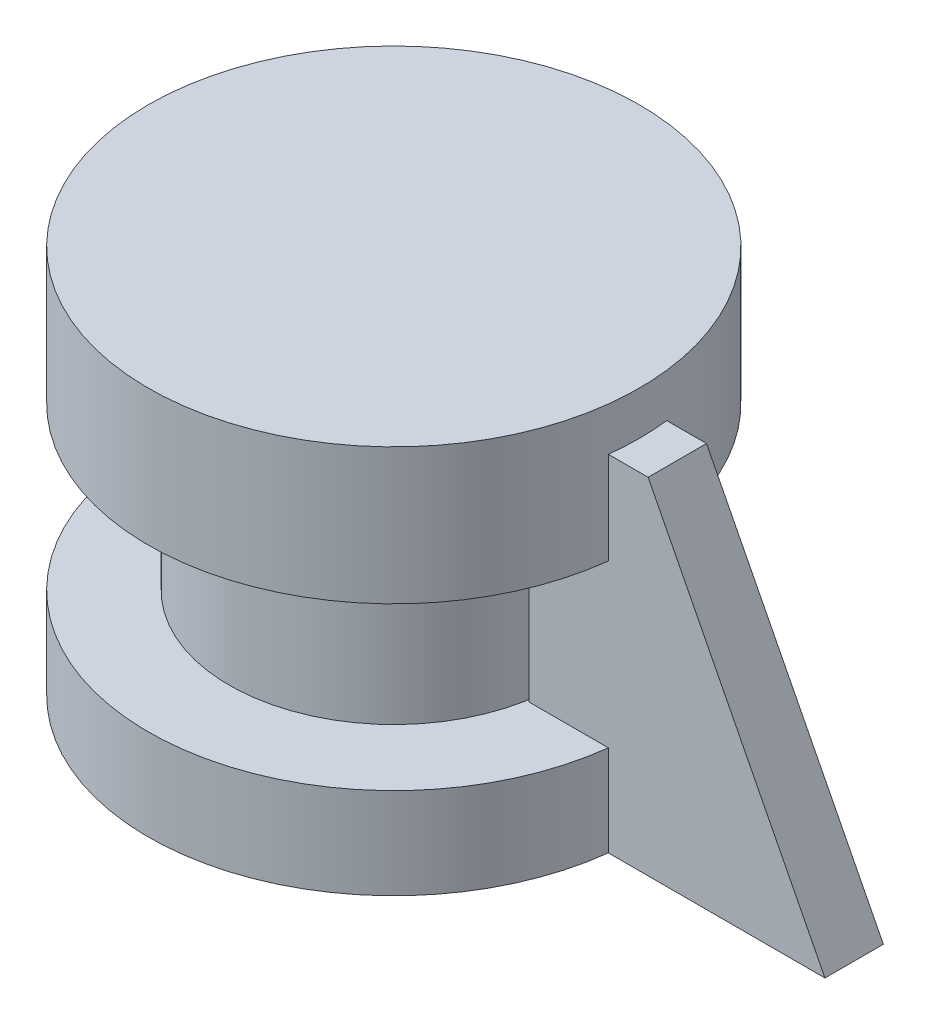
ISO-10303-21;
HEADER;
FILE_DESCRIPTION(('STEP AP214'),'2;1');
FILE_NAME('part.step','',(''),(''),'','','');
FILE_SCHEMA(('AUTOMOTIVE_DESIGN { 1 0 10303 214 1 1 1 1 }'));
ENDSEC;
DATA;
#1=APPLICATION_CONTEXT('core data for automotive mechanical design processes');
#2=APPLICATION_PROTOCOL_DEFINITION('international standard','automotive_design',2000,#1);
#3=PRODUCT_CONTEXT('',#1,'mechanical');
#4=PRODUCT('Part','Part','',(#3));
#5=PRODUCT_RELATED_PRODUCT_CATEGORY('part','',(#4));
#6=PRODUCT_DEFINITION_FORMATION('','',#4);
#7=PRODUCT_DEFINITION_CONTEXT('part definition',#1,'design');
#8=PRODUCT_DEFINITION('design','',#6,#7);
#9=PRODUCT_DEFINITION_SHAPE('','',#8);
#10=(LENGTH_UNIT() NAMED_UNIT(*) SI_UNIT(.MILLI.,.METRE.));
#11=(NAMED_UNIT(*) PLANE_ANGLE_UNIT() SI_UNIT($,.RADIAN.));
#12=(NAMED_UNIT(*) SI_UNIT($,.STERADIAN.) SOLID_ANGLE_UNIT());
#13=UNCERTAINTY_MEASURE_WITH_UNIT(LENGTH_MEASURE(1.E-05),#10,'distance_accuracy_value','');
#14=(GEOMETRIC_REPRESENTATION_CONTEXT(3) GLOBAL_UNCERTAINTY_ASSIGNED_CONTEXT((#13)) GLOBAL_UNIT_ASSIGNED_CONTEXT((#10,
#11,#12)) REPRESENTATION_CONTEXT('',''));
#15=CARTESIAN_POINT('',(0.,0.,0.));
#16=DIRECTION('',(0.,0.,1.));
#17=DIRECTION('',(1.,0.,0.));
#18=AXIS2_PLACEMENT_3D('',#15,#16,#17);
#19=CARTESIAN_POINT('',(-28.1825835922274,69.7762074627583,0.));
#20=DIRECTION('',(0.,1.,0.));
#21=DIRECTION('',(-1.,0.,0.));
#22=AXIS2_PLACEMENT_3D('',#19,#20,#21);
#23=CYLINDRICAL_SURFACE('',#22,28.1825835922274);
#24=CARTESIAN_POINT('',(-28.1825835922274,15.5921879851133,0.));
#25=DIRECTION('',(0.,1.,0.));
#26=DIRECTION('',(-1.,0.,0.));
#27=AXIS2_PLACEMENT_3D('',#24,#25,#26);
#28=CIRCLE('',#27,28.1825835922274);
#29=CARTESIAN_POINT('',(0.,15.5921879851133,0.));
#30=VERTEX_POINT('',#29);
#31=EDGE_CURVE('E161',#30,#30,#28,.T.);
#32=ORIENTED_EDGE('',*,*,#31,.T.);
#33=EDGE_LOOP('',(#32));
#34=FACE_BOUND('',#33,.T.);
#35=CARTESIAN_POINT('',(-28.1825835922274,43.2930069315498,0.));
#36=DIRECTION('',(0.,1.,0.));
#37=DIRECTION('',(-1.,0.,0.));
#38=AXIS2_PLACEMENT_3D('',#35,#36,#37);
#39=CIRCLE('',#38,28.1825835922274);
#40=CARTESIAN_POINT('',(0.,43.2930069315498,0.));
#41=VERTEX_POINT('',#40);
#42=EDGE_CURVE('E176',#41,#41,#39,.T.);
#43=ORIENTED_EDGE('',*,*,#42,.F.);
#44=EDGE_LOOP('',(#43));
#45=FACE_BOUND('',#44,.T.);
#46=ADVANCED_FACE('F43',(#34,#45),#23,.T.);
#47=CARTESIAN_POINT('',(10.6290033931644,43.2930069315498,0.));
#48=DIRECTION('',(0.,-1.,0.));
#49=DIRECTION('',(1.,0.,0.));
#50=AXIS2_PLACEMENT_3D('',#47,#48,#49);
#51=PLANE('',#50);
#52=DIRECTION('',(-1.,0.,0.));
#53=VECTOR('',#52,1.);
#54=CARTESIAN_POINT('',(10.6290033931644,43.2930069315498,5.));
#55=LINE('',#54,#53);
#56=CARTESIAN_POINT('',(13.5603538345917,43.2930069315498,5.));
#57=VERTEX_POINT('',#56);
#58=CARTESIAN_POINT('',(0.,43.2930069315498,5.));
#59=VERTEX_POINT('',#58);
#60=EDGE_CURVE('E159',#57,#59,#55,.T.);
#61=ORIENTED_EDGE('',*,*,#60,.F.);
#62=CARTESIAN_POINT('',(-28.1825835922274,43.2930069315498,0.));
#63=DIRECTION('',(0.,1.,0.));
#64=DIRECTION('',(-1.,0.,0.));
#65=AXIS2_PLACEMENT_3D('',#62,#63,#64);
#66=CIRCLE('',#65,42.0413228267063);
#67=CARTESIAN_POINT('',(13.5603538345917,43.2930069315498,-5.));
#68=VERTEX_POINT('',#67);
#69=EDGE_CURVE('E173',#68,#57,#66,.T.);
#70=ORIENTED_EDGE('',*,*,#69,.F.);
#71=DIRECTION('',(1.,0.,0.));
#72=VECTOR('',#71,1.);
#73=CARTESIAN_POINT('',(10.6290033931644,43.2930069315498,-5.));
#74=LINE('',#73,#72);
#75=CARTESIAN_POINT('',(0.,43.2930069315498,-5.));
#76=VERTEX_POINT('',#75);
#77=EDGE_CURVE('E57',#76,#68,#74,.T.);
#78=ORIENTED_EDGE('',*,*,#77,.F.);
#79=DIRECTION('',(0.,0.,-1.));
#80=VECTOR('',#79,1.);
#81=CARTESIAN_POINT('',(0.,43.2930069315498,0.));
#82=LINE('',#81,#80);
#83=EDGE_CURVE('E129',#41,#76,#82,.T.);
#84=ORIENTED_EDGE('',*,*,#83,.F.);
#85=ORIENTED_EDGE('',*,*,#42,.T.);
#86=EDGE_CURVE('E150',#59,#41,#82,.T.);
#87=ORIENTED_EDGE('',*,*,#86,.F.);
#88=EDGE_LOOP('',(#61,#70,#78,#84,#85,#87));
#89=FACE_BOUND('',#88,.T.);
#90=ADVANCED_FACE('F215',(#89),#51,.T.);
#91=CARTESIAN_POINT('',(-28.1825835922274,69.7762074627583,0.));
#92=DIRECTION('',(0.,1.,0.));
#93=DIRECTION('',(-1.,0.,0.));
#94=AXIS2_PLACEMENT_3D('',#91,#92,#93);
#95=CYLINDRICAL_SURFACE('',#94,42.0413228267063);
#96=DIRECTION('',(0.,1.,0.));
#97=VECTOR('',#96,1.);
#98=CARTESIAN_POINT('',(13.5603538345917,69.7762074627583,5.));
#99=LINE('',#98,#97);
#100=CARTESIAN_POINT('',(13.5603538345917,59.1220463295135,5.));
#101=VERTEX_POINT('',#100);
#102=EDGE_CURVE('E157',#101,#57,#99,.F.);
#103=ORIENTED_EDGE('',*,*,#102,.F.);
#104=CARTESIAN_POINT('',(-28.1825835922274,59.1220463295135,0.));
#105=DIRECTION('',(0.,1.,0.));
#106=DIRECTION('',(0.,0.,1.));
#107=AXIS2_PLACEMENT_3D('',#104,#105,#106);
#108=CIRCLE('',#107,42.0413228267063);
#109=CARTESIAN_POINT('',(13.5603538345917,59.1220463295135,-5.));
#110=VERTEX_POINT('',#109);
#111=EDGE_CURVE('E12',#110,#101,#108,.F.);
#112=ORIENTED_EDGE('',*,*,#111,.F.);
#113=DIRECTION('',(0.,1.,0.));
#114=VECTOR('',#113,1.);
#115=CARTESIAN_POINT('',(13.5603538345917,69.7762074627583,-5.));
#116=LINE('',#115,#114);
#117=EDGE_CURVE('E116',#68,#110,#116,.T.);
#118=ORIENTED_EDGE('',*,*,#117,.F.);
#119=ORIENTED_EDGE('',*,*,#69,.T.);
#120=EDGE_LOOP('',(#103,#112,#118,#119));
#121=FACE_BOUND('',#120,.T.);
#122=CARTESIAN_POINT('',(-28.1825835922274,66.5799591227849,0.));
#123=DIRECTION('',(0.,1.,0.));
#124=DIRECTION('',(-1.,0.,0.));
#125=AXIS2_PLACEMENT_3D('',#122,#123,#124);
#126=CIRCLE('',#125,42.0413228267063);
#127=CARTESIAN_POINT('',(-70.2239064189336,66.5799591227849,0.));
#128=VERTEX_POINT('',#127);
#129=EDGE_CURVE('E170',#128,#128,#126,.T.);
#130=ORIENTED_EDGE('',*,*,#129,.F.);
#131=EDGE_LOOP('',(#130));
#132=FACE_BOUND('',#131,.T.);
#133=ADVANCED_FACE('F211',(#121,#132),#95,.T.);
#134=CARTESIAN_POINT('',(10.6290033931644,66.5799591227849,0.));
#135=DIRECTION('',(0.,1.,0.));
#136=DIRECTION('',(-1.,0.,0.));
#137=AXIS2_PLACEMENT_3D('',#134,#135,#136);
#138=PLANE('',#137);
#139=ORIENTED_EDGE('',*,*,#129,.T.);
#140=EDGE_LOOP('',(#139));
#141=FACE_BOUND('',#140,.T.);
#142=ADVANCED_FACE('F204',(#141),#138,.T.);
#143=CARTESIAN_POINT('',(10.6290033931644,0.,0.));
#144=DIRECTION('',(0.,-1.,0.));
#145=DIRECTION('',(1.,0.,0.));
#146=AXIS2_PLACEMENT_3D('',#143,#144,#145);
#147=PLANE('',#146);
#148=DIRECTION('',(-1.,0.,0.));
#149=VECTOR('',#148,1.);
#150=CARTESIAN_POINT('',(50.6582087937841,0.,5.));
#151=LINE('',#150,#149);
#152=CARTESIAN_POINT('',(13.5603538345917,0.,5.));
#153=VERTEX_POINT('',#152);
#154=CARTESIAN_POINT('',(0.,0.,5.));
#155=VERTEX_POINT('',#154);
#156=EDGE_CURVE('E145',#153,#155,#151,.T.);
#157=ORIENTED_EDGE('',*,*,#156,.F.);
#158=CARTESIAN_POINT('',(-28.1825835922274,0.,0.));
#159=DIRECTION('',(0.,1.,0.));
#160=DIRECTION('',(-1.,0.,0.));
#161=AXIS2_PLACEMENT_3D('',#158,#159,#160);
#162=CIRCLE('',#161,42.0413228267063);
#163=CARTESIAN_POINT('',(13.5603538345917,0.,-5.));
#164=VERTEX_POINT('',#163);
#165=EDGE_CURVE('E167',#164,#153,#162,.T.);
#166=ORIENTED_EDGE('',*,*,#165,.F.);
#167=DIRECTION('',(-1.,0.,0.));
#168=VECTOR('',#167,1.);
#169=CARTESIAN_POINT('',(50.6582087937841,0.,-5.));
#170=LINE('',#169,#168);
#171=CARTESIAN_POINT('',(0.,0.,-5.));
#172=VERTEX_POINT('',#171);
#173=EDGE_CURVE('E120',#164,#172,#170,.T.);
#174=ORIENTED_EDGE('',*,*,#173,.T.);
#175=DIRECTION('',(0.,0.,1.));
#176=VECTOR('',#175,1.);
#177=CARTESIAN_POINT('',(0.,0.,-5.));
#178=LINE('',#177,#176);
#179=EDGE_CURVE('E130',#172,#155,#178,.T.);
#180=ORIENTED_EDGE('',*,*,#179,.T.);
#181=EDGE_LOOP('',(#157,#166,#174,#180));
#182=FACE_BOUND('',#181,.T.);
#183=ADVANCED_FACE('F202',(#182),#147,.T.);
#184=CARTESIAN_POINT('',(-28.1825835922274,69.7762074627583,0.));
#185=DIRECTION('',(0.,1.,0.));
#186=DIRECTION('',(-1.,0.,0.));
#187=AXIS2_PLACEMENT_3D('',#184,#185,#186);
#188=CYLINDRICAL_SURFACE('',#187,42.0413228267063);
#189=DIRECTION('',(0.,1.,0.));
#190=VECTOR('',#189,1.);
#191=CARTESIAN_POINT('',(13.5603538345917,69.7762074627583,5.));
#192=LINE('',#191,#190);
#193=CARTESIAN_POINT('',(13.5603538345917,15.5921879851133,5.));
#194=VERTEX_POINT('',#193);
#195=EDGE_CURVE('E155',#194,#153,#192,.F.);
#196=ORIENTED_EDGE('',*,*,#195,.F.);
#197=CARTESIAN_POINT('',(-28.1825835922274,15.5921879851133,0.));
#198=DIRECTION('',(0.,1.,0.));
#199=DIRECTION('',(-1.,0.,0.));
#200=AXIS2_PLACEMENT_3D('',#197,#198,#199);
#201=CIRCLE('',#200,42.0413228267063);
#202=CARTESIAN_POINT('',(13.5603538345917,15.5921879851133,-5.));
#203=VERTEX_POINT('',#202);
#204=EDGE_CURVE('E164',#203,#194,#201,.T.);
#205=ORIENTED_EDGE('',*,*,#204,.F.);
#206=DIRECTION('',(0.,1.,0.));
#207=VECTOR('',#206,1.);
#208=CARTESIAN_POINT('',(13.5603538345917,69.7762074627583,-5.));
#209=LINE('',#208,#207);
#210=EDGE_CURVE('E151',#164,#203,#209,.T.);
#211=ORIENTED_EDGE('',*,*,#210,.F.);
#212=ORIENTED_EDGE('',*,*,#165,.T.);
#213=EDGE_LOOP('',(#196,#205,#211,#212));
#214=FACE_BOUND('',#213,.T.);
#215=ADVANCED_FACE('F191',(#214),#188,.T.);
#216=CARTESIAN_POINT('',(10.6290033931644,15.5921879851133,0.));
#217=DIRECTION('',(0.,1.,0.));
#218=DIRECTION('',(-1.,0.,0.));
#219=AXIS2_PLACEMENT_3D('',#216,#217,#218);
#220=PLANE('',#219);
#221=DIRECTION('',(1.,0.,0.));
#222=VECTOR('',#221,1.);
#223=CARTESIAN_POINT('',(10.6290033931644,15.5921879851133,5.));
#224=LINE('',#223,#222);
#225=CARTESIAN_POINT('',(0.,15.5921879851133,5.));
#226=VERTEX_POINT('',#225);
#227=EDGE_CURVE('E50',#226,#194,#224,.T.);
#228=ORIENTED_EDGE('',*,*,#227,.F.);
#229=DIRECTION('',(0.,0.,1.));
#230=VECTOR('',#229,1.);
#231=CARTESIAN_POINT('',(0.,15.5921879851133,0.));
#232=LINE('',#231,#230);
#233=EDGE_CURVE('E179',#30,#226,#232,.T.);
#234=ORIENTED_EDGE('',*,*,#233,.F.);
#235=ORIENTED_EDGE('',*,*,#31,.F.);
#236=CARTESIAN_POINT('',(0.,15.5921879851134,-5.));
#237=VERTEX_POINT('',#236);
#238=EDGE_CURVE('E65',#237,#30,#232,.T.);
#239=ORIENTED_EDGE('',*,*,#238,.F.);
#240=DIRECTION('',(-1.,0.,0.));
#241=VECTOR('',#240,1.);
#242=CARTESIAN_POINT('',(10.6290033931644,15.5921879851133,-5.));
#243=LINE('',#242,#241);
#244=EDGE_CURVE('E181',#203,#237,#243,.T.);
#245=ORIENTED_EDGE('',*,*,#244,.F.);
#246=ORIENTED_EDGE('',*,*,#204,.T.);
#247=EDGE_LOOP('',(#228,#234,#235,#239,#245,#246));
#248=FACE_BOUND('',#247,.T.);
#249=ADVANCED_FACE('F195',(#248),#220,.T.);
#250=CARTESIAN_POINT('',(0.,59.1220463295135,-5.));
#251=DIRECTION('',(-1.,0.,0.));
#252=DIRECTION('',(0.,0.,1.));
#253=AXIS2_PLACEMENT_3D('',#250,#251,#252);
#254=PLANE('',#253);
#255=ORIENTED_EDGE('',*,*,#238,.T.);
#256=ORIENTED_EDGE('',*,*,#233,.T.);
#257=DIRECTION('',(0.,1.,0.));
#258=VECTOR('',#257,1.);
#259=CARTESIAN_POINT('',(0.,0.,5.));
#260=LINE('',#259,#258);
#261=EDGE_CURVE('E121',#155,#226,#260,.T.);
#262=ORIENTED_EDGE('',*,*,#261,.F.);
#263=ORIENTED_EDGE('',*,*,#179,.F.);
#264=DIRECTION('',(0.,-1.,0.));
#265=VECTOR('',#264,1.);
#266=CARTESIAN_POINT('',(0.,59.1220463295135,-5.));
#267=LINE('',#266,#265);
#268=EDGE_CURVE('E131',#237,#172,#267,.T.);
#269=ORIENTED_EDGE('',*,*,#268,.F.);
#270=EDGE_LOOP('',(#255,#256,#262,#263,#269));
#271=FACE_BOUND('',#270,.T.);
#272=ADVANCED_FACE('F200',(#271),#254,.F.);
#273=CARTESIAN_POINT('',(50.6582087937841,59.1220463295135,-5.));
#274=DIRECTION('',(0.,0.,-1.));
#275=DIRECTION('',(-1.,0.,0.));
#276=AXIS2_PLACEMENT_3D('',#273,#274,#275);
#277=PLANE('',#276);
#278=ORIENTED_EDGE('',*,*,#210,.T.);
#279=ORIENTED_EDGE('',*,*,#244,.T.);
#280=ORIENTED_EDGE('',*,*,#268,.T.);
#281=ORIENTED_EDGE('',*,*,#173,.F.);
#282=EDGE_LOOP('',(#278,#279,#280,#281));
#283=FACE_BOUND('',#282,.T.);
#284=ADVANCED_FACE('F198',(#283),#277,.F.);
#285=CARTESIAN_POINT('',(50.6582087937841,0.,5.));
#286=DIRECTION('',(0.,0.,1.));
#287=DIRECTION('',(1.,0.,0.));
#288=AXIS2_PLACEMENT_3D('',#285,#286,#287);
#289=PLANE('',#288);
#290=ORIENTED_EDGE('',*,*,#195,.T.);
#291=ORIENTED_EDGE('',*,*,#156,.T.);
#292=ORIENTED_EDGE('',*,*,#261,.T.);
#293=ORIENTED_EDGE('',*,*,#227,.T.);
#294=EDGE_LOOP('',(#290,#291,#292,#293));
#295=FACE_BOUND('',#294,.T.);
#296=ADVANCED_FACE('F185',(#295),#289,.F.);
#297=ORIENTED_EDGE('',*,*,#60,.T.);
#298=CARTESIAN_POINT('',(0.,59.1220463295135,5.));
#299=VERTEX_POINT('',#298);
#300=EDGE_CURVE('E141',#59,#299,#260,.T.);
#301=ORIENTED_EDGE('',*,*,#300,.T.);
#302=DIRECTION('',(-1.,0.,0.));
#303=VECTOR('',#302,1.);
#304=CARTESIAN_POINT('',(50.6582087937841,59.1220463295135,5.));
#305=LINE('',#304,#303);
#306=EDGE_CURVE('E135',#101,#299,#305,.T.);
#307=ORIENTED_EDGE('',*,*,#306,.F.);
#308=ORIENTED_EDGE('',*,*,#102,.T.);
#309=EDGE_LOOP('',(#297,#301,#307,#308));
#310=FACE_BOUND('',#309,.T.);
#311=ADVANCED_FACE('F230',(#310),#289,.F.);
#312=ORIENTED_EDGE('',*,*,#77,.T.);
#313=ORIENTED_EDGE('',*,*,#117,.T.);
#314=DIRECTION('',(-1.,0.,0.));
#315=VECTOR('',#314,1.);
#316=CARTESIAN_POINT('',(50.6582087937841,59.1220463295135,-5.));
#317=LINE('',#316,#315);
#318=CARTESIAN_POINT('',(0.,59.1220463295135,-5.));
#319=VERTEX_POINT('',#318);
#320=EDGE_CURVE('E112',#110,#319,#317,.T.);
#321=ORIENTED_EDGE('',*,*,#320,.T.);
#322=EDGE_CURVE('E115',#319,#76,#267,.T.);
#323=ORIENTED_EDGE('',*,*,#322,.T.);
#324=EDGE_LOOP('',(#312,#313,#321,#323));
#325=FACE_BOUND('',#324,.T.);
#326=ADVANCED_FACE('F114',(#325),#277,.F.);
#327=ORIENTED_EDGE('',*,*,#86,.T.);
#328=ORIENTED_EDGE('',*,*,#83,.T.);
#329=ORIENTED_EDGE('',*,*,#322,.F.);
#330=DIRECTION('',(0.,0.,-1.));
#331=VECTOR('',#330,1.);
#332=CARTESIAN_POINT('',(0.,59.1220463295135,5.));
#333=LINE('',#332,#331);
#334=EDGE_CURVE('E127',#299,#319,#333,.T.);
#335=ORIENTED_EDGE('',*,*,#334,.F.);
#336=ORIENTED_EDGE('',*,*,#300,.F.);
#337=EDGE_LOOP('',(#327,#328,#329,#335,#336));
#338=FACE_BOUND('',#337,.T.);
#339=ADVANCED_FACE('F125',(#338),#254,.F.);
#340=CARTESIAN_POINT('',(50.6582087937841,59.1220463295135,5.));
#341=DIRECTION('',(0.,1.,0.));
#342=DIRECTION('',(0.,0.,1.));
#343=AXIS2_PLACEMENT_3D('',#340,#341,#342);
#344=PLANE('',#343);
#345=ORIENTED_EDGE('',*,*,#111,.T.);
#346=ORIENTED_EDGE('',*,*,#306,.T.);
#347=ORIENTED_EDGE('',*,*,#334,.T.);
#348=ORIENTED_EDGE('',*,*,#320,.F.);
#349=EDGE_LOOP('',(#345,#346,#347,#348));
#350=FACE_BOUND('',#349,.T.);
#351=ADVANCED_FACE('F133',(#350),#344,.F.);
#352=CLOSED_SHELL('',(#46,#90,#133,#142,#183,#215,#249,#272,#284,#296,#311,#326,#339,#351));
#353=MANIFOLD_SOLID_BREP('B2',#352);
#354=CARTESIAN_POINT('',(50.6582087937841,0.,5.));
#355=DIRECTION('',(-0.890005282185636,-0.455950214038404,0.));
#356=DIRECTION('',(0.455950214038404,-0.890005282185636,0.));
#357=AXIS2_PLACEMENT_3D('',#354,#355,#356);
#358=PLANE('',#357);
#359=DIRECTION('',(-0.455950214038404,0.890005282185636,0.));
#360=VECTOR('',#359,1.);
#361=CARTESIAN_POINT('',(50.6582087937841,0.,-5.));
#362=LINE('',#361,#360);
#363=CARTESIAN_POINT('',(50.6582087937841,0.,-5.));
#364=VERTEX_POINT('',#363);
#365=CARTESIAN_POINT('',(20.3699507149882,59.1220463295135,-5.));
#366=VERTEX_POINT('',#365);
#367=EDGE_CURVE('E399',#364,#366,#362,.T.);
#368=ORIENTED_EDGE('',*,*,#367,.T.);
#369=DIRECTION('',(0.,0.,-1.));
#370=VECTOR('',#369,1.);
#371=CARTESIAN_POINT('',(20.3699507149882,59.1220463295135,5.));
#372=LINE('',#371,#370);
#373=CARTESIAN_POINT('',(20.3699507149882,59.1220463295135,5.));
#374=VERTEX_POINT('',#373);
#375=EDGE_CURVE('E41',#374,#366,#372,.T.);
#376=ORIENTED_EDGE('',*,*,#375,.F.);
#377=DIRECTION('',(-0.455950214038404,0.890005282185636,0.));
#378=VECTOR('',#377,1.);
#379=CARTESIAN_POINT('',(50.6582087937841,0.,5.));
#380=LINE('',#379,#378);
#381=CARTESIAN_POINT('',(50.6582087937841,0.,5.));
#382=VERTEX_POINT('',#381);
#383=EDGE_CURVE('E387',#382,#374,#380,.T.);
#384=ORIENTED_EDGE('',*,*,#383,.F.);
#385=DIRECTION('',(0.,0.,-1.));
#386=VECTOR('',#385,1.);
#387=CARTESIAN_POINT('',(50.6582087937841,0.,5.));
#388=LINE('',#387,#386);
#389=EDGE_CURVE('E395',#382,#364,#388,.T.);
#390=ORIENTED_EDGE('',*,*,#389,.T.);
#391=EDGE_LOOP('',(#368,#376,#384,#390));
#392=FACE_BOUND('',#391,.T.);
#393=ADVANCED_FACE('F336',(#392),#358,.F.);
#394=CARTESIAN_POINT('',(20.3699507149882,59.1220463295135,5.));
#395=DIRECTION('',(0.,-1.,0.));
#396=DIRECTION('',(0.,0.,-1.));
#397=AXIS2_PLACEMENT_3D('',#394,#395,#396);
#398=PLANE('',#397);
#399=DIRECTION('',(-1.,0.,0.));
#400=VECTOR('',#399,1.);
#401=CARTESIAN_POINT('',(20.3699507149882,59.1220463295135,-5.));
#402=LINE('',#401,#400);
#403=CARTESIAN_POINT('',(0.,59.1220463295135,-5.));
#404=VERTEX_POINT('',#403);
#405=EDGE_CURVE('E391',#366,#404,#402,.T.);
#406=ORIENTED_EDGE('',*,*,#405,.T.);
#407=DIRECTION('',(0.,0.,-1.));
#408=VECTOR('',#407,1.);
#409=CARTESIAN_POINT('',(0.,59.1220463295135,5.));
#410=LINE('',#409,#408);
#411=CARTESIAN_POINT('',(0.,59.1220463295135,5.));
#412=VERTEX_POINT('',#411);
#413=EDGE_CURVE('E344',#412,#404,#410,.T.);
#414=ORIENTED_EDGE('',*,*,#413,.F.);
#415=DIRECTION('',(-1.,0.,0.));
#416=VECTOR('',#415,1.);
#417=CARTESIAN_POINT('',(20.3699507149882,59.1220463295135,5.));
#418=LINE('',#417,#416);
#419=EDGE_CURVE('E382',#374,#412,#418,.T.);
#420=ORIENTED_EDGE('',*,*,#419,.F.);
#421=ORIENTED_EDGE('',*,*,#375,.T.);
#422=EDGE_LOOP('',(#406,#414,#420,#421));
#423=FACE_BOUND('',#422,.T.);
#424=ADVANCED_FACE('F390',(#423),#398,.F.);
#425=CARTESIAN_POINT('',(0.,59.1220463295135,5.));
#426=DIRECTION('',(1.,0.,0.));
#427=DIRECTION('',(0.,0.,-1.));
#428=AXIS2_PLACEMENT_3D('',#425,#426,#427);
#429=PLANE('',#428);
#430=DIRECTION('',(0.,-1.,0.));
#431=VECTOR('',#430,1.);
#432=CARTESIAN_POINT('',(0.,59.1220463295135,-5.));
#433=LINE('',#432,#431);
#434=CARTESIAN_POINT('',(0.,0.,-5.));
#435=VERTEX_POINT('',#434);
#436=EDGE_CURVE('E369',#404,#435,#433,.T.);
#437=ORIENTED_EDGE('',*,*,#436,.T.);
#438=DIRECTION('',(0.,0.,-1.));
#439=VECTOR('',#438,1.);
#440=CARTESIAN_POINT('',(0.,0.,5.));
#441=LINE('',#440,#439);
#442=CARTESIAN_POINT('',(0.,0.,5.));
#443=VERTEX_POINT('',#442);
#444=EDGE_CURVE('E392',#443,#435,#441,.T.);
#445=ORIENTED_EDGE('',*,*,#444,.F.);
#446=DIRECTION('',(0.,-1.,0.));
#447=VECTOR('',#446,1.);
#448=CARTESIAN_POINT('',(0.,59.1220463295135,5.));
#449=LINE('',#448,#447);
#450=EDGE_CURVE('E385',#412,#443,#449,.T.);
#451=ORIENTED_EDGE('',*,*,#450,.F.);
#452=ORIENTED_EDGE('',*,*,#413,.T.);
#453=EDGE_LOOP('',(#437,#445,#451,#452));
#454=FACE_BOUND('',#453,.T.);
#455=ADVANCED_FACE('F393',(#454),#429,.F.);
#456=CARTESIAN_POINT('',(0.,0.,5.));
#457=DIRECTION('',(0.,1.,0.));
#458=DIRECTION('',(0.,0.,1.));
#459=AXIS2_PLACEMENT_3D('',#456,#457,#458);
#460=PLANE('',#459);
#461=DIRECTION('',(1.,0.,0.));
#462=VECTOR('',#461,1.);
#463=CARTESIAN_POINT('',(0.,0.,-5.));
#464=LINE('',#463,#462);
#465=EDGE_CURVE('E375',#435,#364,#464,.T.);
#466=ORIENTED_EDGE('',*,*,#465,.T.);
#467=ORIENTED_EDGE('',*,*,#389,.F.);
#468=DIRECTION('',(1.,0.,0.));
#469=VECTOR('',#468,1.);
#470=CARTESIAN_POINT('',(0.,0.,5.));
#471=LINE('',#470,#469);
#472=EDGE_CURVE('E352',#443,#382,#471,.T.);
#473=ORIENTED_EDGE('',*,*,#472,.F.);
#474=ORIENTED_EDGE('',*,*,#444,.T.);
#475=EDGE_LOOP('',(#466,#467,#473,#474));
#476=FACE_BOUND('',#475,.T.);
#477=ADVANCED_FACE('F406',(#476),#460,.F.);
#478=CARTESIAN_POINT('',(20.3699507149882,59.1220463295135,5.));
#479=DIRECTION('',(0.,0.,1.));
#480=DIRECTION('',(1.,0.,0.));
#481=AXIS2_PLACEMENT_3D('',#478,#479,#480);
#482=PLANE('',#481);
#483=ORIENTED_EDGE('',*,*,#383,.T.);
#484=ORIENTED_EDGE('',*,*,#419,.T.);
#485=ORIENTED_EDGE('',*,*,#450,.T.);
#486=ORIENTED_EDGE('',*,*,#472,.T.);
#487=EDGE_LOOP('',(#483,#484,#485,#486));
#488=FACE_BOUND('',#487,.T.);
#489=ADVANCED_FACE('F383',(#488),#482,.T.);
#490=CARTESIAN_POINT('',(20.3699507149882,59.1220463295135,-5.));
#491=DIRECTION('',(0.,0.,1.));
#492=DIRECTION('',(1.,0.,0.));
#493=AXIS2_PLACEMENT_3D('',#490,#491,#492);
#494=PLANE('',#493);
#495=ORIENTED_EDGE('',*,*,#367,.F.);
#496=ORIENTED_EDGE('',*,*,#465,.F.);
#497=ORIENTED_EDGE('',*,*,#436,.F.);
#498=ORIENTED_EDGE('',*,*,#405,.F.);
#499=EDGE_LOOP('',(#495,#496,#497,#498));
#500=FACE_BOUND('',#499,.T.);
#501=ADVANCED_FACE('F409',(#500),#494,.F.);
#502=CLOSED_SHELL('',(#393,#424,#455,#477,#489,#501));
#503=MANIFOLD_SOLID_BREP('B6',#502);
#504=ADVANCED_BREP_SHAPE_REPRESENTATION('',(#18,#353,#503),#14);
#505=SHAPE_DEFINITION_REPRESENTATION(#9,#504);
ENDSEC;
END-ISO-10303-21;
